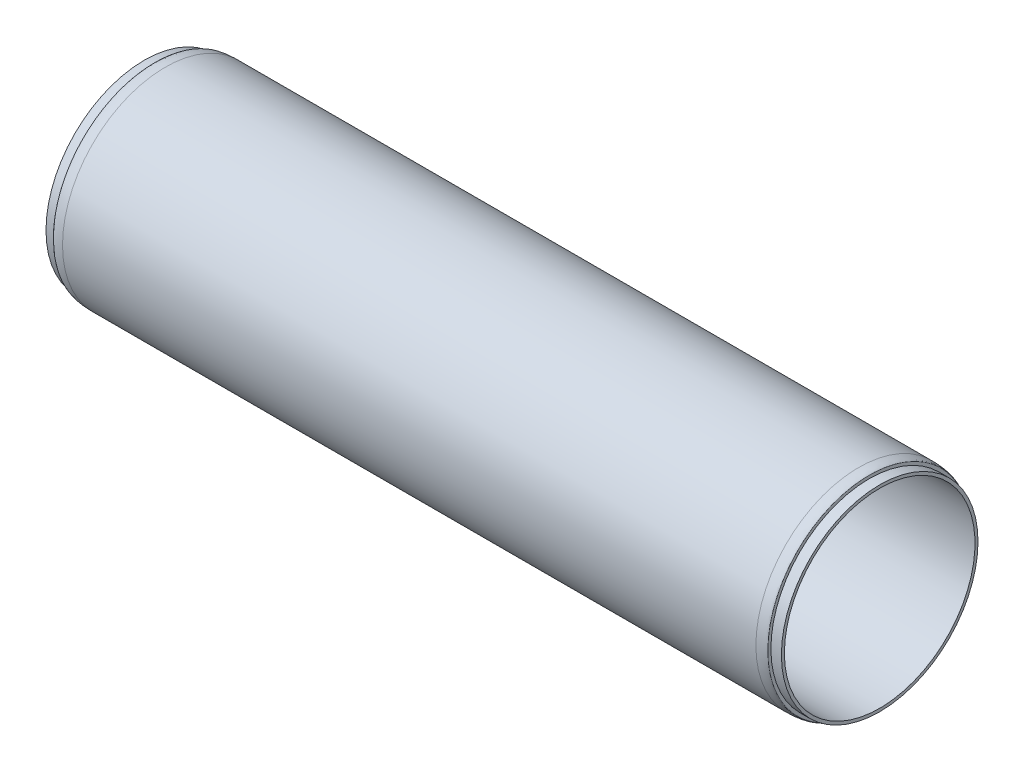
ISO-10303-21;
HEADER;
FILE_DESCRIPTION(('STEP AP214'),'2;1');
FILE_NAME('part.step','',(''),(''),'','','');
FILE_SCHEMA(('AUTOMOTIVE_DESIGN { 1 0 10303 214 1 1 1 1 }'));
ENDSEC;
DATA;
#1=APPLICATION_CONTEXT('core data for automotive mechanical design processes');
#2=APPLICATION_PROTOCOL_DEFINITION('international standard','automotive_design',2000,#1);
#3=PRODUCT_CONTEXT('',#1,'mechanical');
#4=PRODUCT('Part','Part','',(#3));
#5=PRODUCT_RELATED_PRODUCT_CATEGORY('part','',(#4));
#6=PRODUCT_DEFINITION_FORMATION('','',#4);
#7=PRODUCT_DEFINITION_CONTEXT('part definition',#1,'design');
#8=PRODUCT_DEFINITION('design','',#6,#7);
#9=PRODUCT_DEFINITION_SHAPE('','',#8);
#10=(LENGTH_UNIT() NAMED_UNIT(*) SI_UNIT(.MILLI.,.METRE.));
#11=(NAMED_UNIT(*) PLANE_ANGLE_UNIT() SI_UNIT($,.RADIAN.));
#12=(NAMED_UNIT(*) SI_UNIT($,.STERADIAN.) SOLID_ANGLE_UNIT());
#13=UNCERTAINTY_MEASURE_WITH_UNIT(LENGTH_MEASURE(1.E-05),#10,'distance_accuracy_value','');
#14=(GEOMETRIC_REPRESENTATION_CONTEXT(3) GLOBAL_UNCERTAINTY_ASSIGNED_CONTEXT((#13)) GLOBAL_UNIT_ASSIGNED_CONTEXT((#10,
#11,#12)) REPRESENTATION_CONTEXT('',''));
#15=CARTESIAN_POINT('',(0.,0.,0.));
#16=DIRECTION('',(0.,0.,1.));
#17=DIRECTION('',(1.,0.,0.));
#18=AXIS2_PLACEMENT_3D('',#15,#16,#17);
#19=CARTESIAN_POINT('',(62.23,0.,0.));
#20=DIRECTION('',(1.,0.,0.));
#21=DIRECTION('',(0.,0.,-1.));
#22=AXIS2_PLACEMENT_3D('',#19,#20,#21);
#23=PLANE('',#22);
#24=CARTESIAN_POINT('',(62.23,0.,0.));
#25=DIRECTION('',(1.,0.,0.));
#26=DIRECTION('',(0.,0.,-1.));
#27=AXIS2_PLACEMENT_3D('',#24,#25,#26);
#28=CIRCLE('',#27,8.3185);
#29=CARTESIAN_POINT('',(62.23,0.,-8.3185));
#30=VERTEX_POINT('',#29);
#31=EDGE_CURVE('E68',#30,#30,#28,.T.);
#32=ORIENTED_EDGE('',*,*,#31,.T.);
#33=EDGE_LOOP('',(#32));
#34=FACE_BOUND('',#33,.T.);
#35=CARTESIAN_POINT('',(62.23,0.,0.));
#36=DIRECTION('',(1.,0.,0.));
#37=DIRECTION('',(0.,0.,-1.));
#38=AXIS2_PLACEMENT_3D('',#35,#36,#37);
#39=CIRCLE('',#38,8.0645);
#40=CARTESIAN_POINT('',(62.23,0.,8.0645));
#41=VERTEX_POINT('',#40);
#42=EDGE_CURVE('E11',#41,#41,#39,.T.);
#43=ORIENTED_EDGE('',*,*,#42,.F.);
#44=EDGE_LOOP('',(#43));
#45=FACE_BOUND('',#44,.T.);
#46=ADVANCED_FACE('F42',(#34,#45),#23,.T.);
#47=CARTESIAN_POINT('',(0.,0.,0.));
#48=DIRECTION('',(1.,0.,0.));
#49=DIRECTION('',(0.,0.,-1.));
#50=AXIS2_PLACEMENT_3D('',#47,#48,#49);
#51=PLANE('',#50);
#52=CARTESIAN_POINT('',(0.,0.,0.));
#53=DIRECTION('',(1.,0.,0.));
#54=DIRECTION('',(0.,0.,-1.));
#55=AXIS2_PLACEMENT_3D('',#52,#53,#54);
#56=CIRCLE('',#55,8.3185);
#57=CARTESIAN_POINT('',(0.,0.,-8.3185));
#58=VERTEX_POINT('',#57);
#59=EDGE_CURVE('E53',#58,#58,#56,.T.);
#60=ORIENTED_EDGE('',*,*,#59,.F.);
#61=EDGE_LOOP('',(#60));
#62=FACE_BOUND('',#61,.T.);
#63=CARTESIAN_POINT('',(0.,0.,0.));
#64=DIRECTION('',(1.,0.,0.));
#65=DIRECTION('',(0.,0.,-1.));
#66=AXIS2_PLACEMENT_3D('',#63,#64,#65);
#67=CIRCLE('',#66,8.0645);
#68=CARTESIAN_POINT('',(0.,0.,8.0645));
#69=VERTEX_POINT('',#68);
#70=EDGE_CURVE('E49',#69,#69,#67,.T.);
#71=ORIENTED_EDGE('',*,*,#70,.T.);
#72=EDGE_LOOP('',(#71));
#73=FACE_BOUND('',#72,.T.);
#74=ADVANCED_FACE('F91',(#62,#73),#51,.F.);
#75=CARTESIAN_POINT('',(62.23,0.,0.));
#76=DIRECTION('',(-1.,0.,0.));
#77=DIRECTION('',(0.,0.,1.));
#78=AXIS2_PLACEMENT_3D('',#75,#76,#77);
#79=CYLINDRICAL_SURFACE('',#78,8.6995);
#80=CARTESIAN_POINT('',(60.452,0.,0.));
#81=DIRECTION('',(1.,0.,0.));
#82=DIRECTION('',(0.,0.,-1.));
#83=AXIS2_PLACEMENT_3D('',#80,#81,#82);
#84=CIRCLE('',#83,8.6995);
#85=CARTESIAN_POINT('',(60.452,0.,8.6995));
#86=VERTEX_POINT('',#85);
#87=EDGE_CURVE('E109',#86,#86,#84,.T.);
#88=CARTESIAN_POINT('',(1.778,0.,0.));
#89=DIRECTION('',(1.,0.,0.));
#90=DIRECTION('',(0.,0.,-1.));
#91=AXIS2_PLACEMENT_3D('',#88,#89,#90);
#92=CIRCLE('',#91,8.6995);
#93=CARTESIAN_POINT('',(1.778,0.,8.6995));
#94=VERTEX_POINT('',#93);
#95=EDGE_CURVE('E65',#94,#94,#92,.T.);
#96=CARTESIAN_POINT('',(60.452,0.,8.6995));
#97=CARTESIAN_POINT('',(59.8408125,0.,8.6995));
#98=CARTESIAN_POINT('',(59.229625,0.,8.6995));
#99=CARTESIAN_POINT('',(58.00725,0.,8.6995));
#100=CARTESIAN_POINT('',(57.3960625,0.,8.6995));
#101=CARTESIAN_POINT('',(56.1736875,0.,8.6995));
#102=CARTESIAN_POINT('',(55.5625,0.,8.6995));
#103=CARTESIAN_POINT('',(54.340125,0.,8.6995));
#104=CARTESIAN_POINT('',(53.7289375,0.,8.6995));
#105=CARTESIAN_POINT('',(52.5065625,0.,8.6995));
#106=CARTESIAN_POINT('',(51.895375,0.,8.6995));
#107=CARTESIAN_POINT('',(50.673,0.,8.6995));
#108=CARTESIAN_POINT('',(50.0618125,0.,8.6995));
#109=CARTESIAN_POINT('',(48.8394375,0.,8.6995));
#110=CARTESIAN_POINT('',(48.22825,0.,8.6995));
#111=CARTESIAN_POINT('',(47.005875,0.,8.6995));
#112=CARTESIAN_POINT('',(46.3946875,0.,8.6995));
#113=CARTESIAN_POINT('',(45.1723125,0.,8.6995));
#114=CARTESIAN_POINT('',(44.561125,0.,8.6995));
#115=CARTESIAN_POINT('',(43.33875,0.,8.6995));
#116=CARTESIAN_POINT('',(42.7275625,0.,8.6995));
#117=CARTESIAN_POINT('',(41.5051875,0.,8.6995));
#118=CARTESIAN_POINT('',(40.894,0.,8.6995));
#119=CARTESIAN_POINT('',(39.671625,0.,8.6995));
#120=CARTESIAN_POINT('',(39.0604375,0.,8.6995));
#121=CARTESIAN_POINT('',(37.8380625,0.,8.6995));
#122=CARTESIAN_POINT('',(37.226875,0.,8.6995));
#123=CARTESIAN_POINT('',(36.0045,0.,8.6995));
#124=CARTESIAN_POINT('',(35.3933125,0.,8.6995));
#125=CARTESIAN_POINT('',(34.1709375,0.,8.6995));
#126=CARTESIAN_POINT('',(33.55975,0.,8.6995));
#127=CARTESIAN_POINT('',(32.337375,0.,8.6995));
#128=CARTESIAN_POINT('',(31.7261875,0.,8.6995));
#129=CARTESIAN_POINT('',(30.5038125,0.,8.6995));
#130=CARTESIAN_POINT('',(29.892625,0.,8.6995));
#131=CARTESIAN_POINT('',(28.67025,0.,8.6995));
#132=CARTESIAN_POINT('',(28.0590625,0.,8.6995));
#133=CARTESIAN_POINT('',(26.8366875,0.,8.6995));
#134=CARTESIAN_POINT('',(26.2255,0.,8.6995));
#135=CARTESIAN_POINT('',(25.003125,0.,8.6995));
#136=CARTESIAN_POINT('',(24.3919375,0.,8.6995));
#137=CARTESIAN_POINT('',(23.1695625,0.,8.6995));
#138=CARTESIAN_POINT('',(22.558375,0.,8.6995));
#139=CARTESIAN_POINT('',(21.336,0.,8.6995));
#140=CARTESIAN_POINT('',(20.7248125,0.,8.6995));
#141=CARTESIAN_POINT('',(19.5024375,0.,8.6995));
#142=CARTESIAN_POINT('',(18.89125,0.,8.6995));
#143=CARTESIAN_POINT('',(17.668875,0.,8.6995));
#144=CARTESIAN_POINT('',(17.0576875,0.,8.6995));
#145=CARTESIAN_POINT('',(15.8353125,0.,8.6995));
#146=CARTESIAN_POINT('',(15.224125,0.,8.6995));
#147=CARTESIAN_POINT('',(14.00175,0.,8.6995));
#148=CARTESIAN_POINT('',(13.3905625,0.,8.6995));
#149=CARTESIAN_POINT('',(12.1681875,0.,8.6995));
#150=CARTESIAN_POINT('',(11.557,0.,8.6995));
#151=CARTESIAN_POINT('',(10.334625,0.,8.6995));
#152=CARTESIAN_POINT('',(9.7234375,0.,8.6995));
#153=CARTESIAN_POINT('',(8.5010625,0.,8.6995));
#154=CARTESIAN_POINT('',(7.889875,0.,8.6995));
#155=CARTESIAN_POINT('',(6.6675,0.,8.6995));
#156=CARTESIAN_POINT('',(6.0563125,0.,8.6995));
#157=CARTESIAN_POINT('',(4.8339375,0.,8.6995));
#158=CARTESIAN_POINT('',(4.22275,0.,8.6995));
#159=CARTESIAN_POINT('',(3.000375,0.,8.6995));
#160=CARTESIAN_POINT('',(2.3891875,0.,8.6995));
#161=CARTESIAN_POINT('',(1.778,0.,8.6995));
#162=B_SPLINE_CURVE_WITH_KNOTS('',3,(#96,#97,#98,#99,#100,#101,#102,#103,#104,#105,#106,#107,
#108,#109,#110,#111,#112,#113,#114,#115,#116,#117,#118,#119,#120,#121,#122,#123,#124,#125,#126,
#127,#128,#129,#130,#131,#132,#133,#134,#135,#136,#137,#138,#139,#140,#141,#142,#143,#144,#145,
#146,#147,#148,#149,#150,#151,#152,#153,#154,#155,#156,#157,#158,#159,#160,#161),.UNSPECIFIED.,
.F.,.F.,(4,2,2,2,2,2,2,2,2,2,2,2,2,2,2,2,2,2,2,2,2,2,2,2,2,2,2,2,2,2,2,2,4),(0.,1.8335625,
3.667125,5.5006875,7.33425,9.1678125,11.001375,12.8349375,14.6685,16.5020625,18.335625,
20.1691875,22.00275,23.8363125,25.669875,27.5034375,29.337,31.1705625,33.004125,34.8376875,
36.67125,38.5048125,40.338375,42.1719375,44.0055,45.8390625,47.672625,49.5061875,51.33975,
53.1733125,55.006875,56.8404375,58.674),.UNSPECIFIED.);
#163=EDGE_CURVE('BSEAM44',#86,#94,#162,.T.);
#164=ORIENTED_EDGE('',*,*,#87,.F.);
#165=ORIENTED_EDGE('',*,*,#95,.T.);
#166=ORIENTED_EDGE('',*,*,#163,.T.);
#167=ORIENTED_EDGE('',*,*,#163,.F.);
#168=EDGE_LOOP('',(#164,#166,#165,#167));
#169=FACE_BOUND('',#168,.T.);
#170=ADVANCED_FACE('F44',(#169),#79,.T.);
#171=CARTESIAN_POINT('',(62.23,0.,0.));
#172=DIRECTION('',(-1.,0.,0.));
#173=DIRECTION('',(0.,0.,1.));
#174=AXIS2_PLACEMENT_3D('',#171,#172,#173);
#175=CYLINDRICAL_SURFACE('',#174,8.0645);
#176=CARTESIAN_POINT('',(62.23,0.,8.0645));
#177=CARTESIAN_POINT('',(61.5817708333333,0.,8.0645));
#178=CARTESIAN_POINT('',(60.9335416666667,0.,8.0645));
#179=CARTESIAN_POINT('',(59.6370833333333,0.,8.0645));
#180=CARTESIAN_POINT('',(58.9888541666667,0.,8.0645));
#181=CARTESIAN_POINT('',(57.6923958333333,0.,8.0645));
#182=CARTESIAN_POINT('',(57.0441666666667,0.,8.0645));
#183=CARTESIAN_POINT('',(55.7477083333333,0.,8.0645));
#184=CARTESIAN_POINT('',(55.0994791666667,0.,8.0645));
#185=CARTESIAN_POINT('',(53.8030208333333,0.,8.0645));
#186=CARTESIAN_POINT('',(53.1547916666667,0.,8.0645));
#187=CARTESIAN_POINT('',(51.8583333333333,0.,8.0645));
#188=CARTESIAN_POINT('',(51.2101041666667,0.,8.0645));
#189=CARTESIAN_POINT('',(49.9136458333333,0.,8.0645));
#190=CARTESIAN_POINT('',(49.2654166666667,0.,8.0645));
#191=CARTESIAN_POINT('',(47.9689583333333,0.,8.0645));
#192=CARTESIAN_POINT('',(47.3207291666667,0.,8.0645));
#193=CARTESIAN_POINT('',(46.0242708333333,0.,8.0645));
#194=CARTESIAN_POINT('',(45.3760416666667,0.,8.0645));
#195=CARTESIAN_POINT('',(44.0795833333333,0.,8.0645));
#196=CARTESIAN_POINT('',(43.4313541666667,0.,8.0645));
#197=CARTESIAN_POINT('',(42.1348958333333,0.,8.0645));
#198=CARTESIAN_POINT('',(41.4866666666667,0.,8.0645));
#199=CARTESIAN_POINT('',(40.1902083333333,0.,8.0645));
#200=CARTESIAN_POINT('',(39.5419791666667,0.,8.0645));
#201=CARTESIAN_POINT('',(38.2455208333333,0.,8.0645));
#202=CARTESIAN_POINT('',(37.5972916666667,0.,8.0645));
#203=CARTESIAN_POINT('',(36.3008333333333,0.,8.0645));
#204=CARTESIAN_POINT('',(35.6526041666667,0.,8.0645));
#205=CARTESIAN_POINT('',(34.3561458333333,0.,8.0645));
#206=CARTESIAN_POINT('',(33.7079166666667,0.,8.0645));
#207=CARTESIAN_POINT('',(32.4114583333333,0.,8.0645));
#208=CARTESIAN_POINT('',(31.7632291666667,0.,8.0645));
#209=CARTESIAN_POINT('',(30.4667708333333,0.,8.0645));
#210=CARTESIAN_POINT('',(29.8185416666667,0.,8.0645));
#211=CARTESIAN_POINT('',(28.5220833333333,0.,8.0645));
#212=CARTESIAN_POINT('',(27.8738541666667,0.,8.0645));
#213=CARTESIAN_POINT('',(26.5773958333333,0.,8.0645));
#214=CARTESIAN_POINT('',(25.9291666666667,0.,8.0645));
#215=CARTESIAN_POINT('',(24.6327083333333,0.,8.0645));
#216=CARTESIAN_POINT('',(23.9844791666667,0.,8.0645));
#217=CARTESIAN_POINT('',(22.6880208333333,0.,8.0645));
#218=CARTESIAN_POINT('',(22.0397916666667,0.,8.0645));
#219=CARTESIAN_POINT('',(20.7433333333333,0.,8.0645));
#220=CARTESIAN_POINT('',(20.0951041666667,0.,8.0645));
#221=CARTESIAN_POINT('',(18.7986458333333,0.,8.0645));
#222=CARTESIAN_POINT('',(18.1504166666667,0.,8.0645));
#223=CARTESIAN_POINT('',(16.8539583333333,0.,8.0645));
#224=CARTESIAN_POINT('',(16.2057291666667,0.,8.0645));
#225=CARTESIAN_POINT('',(14.9092708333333,0.,8.0645));
#226=CARTESIAN_POINT('',(14.2610416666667,0.,8.0645));
#227=CARTESIAN_POINT('',(12.9645833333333,0.,8.0645));
#228=CARTESIAN_POINT('',(12.3163541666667,0.,8.0645));
#229=CARTESIAN_POINT('',(11.0198958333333,0.,8.0645));
#230=CARTESIAN_POINT('',(10.3716666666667,0.,8.0645));
#231=CARTESIAN_POINT('',(9.07520833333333,0.,8.0645));
#232=CARTESIAN_POINT('',(8.42697916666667,0.,8.0645));
#233=CARTESIAN_POINT('',(7.13052083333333,0.,8.0645));
#234=CARTESIAN_POINT('',(6.48229166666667,0.,8.0645));
#235=CARTESIAN_POINT('',(5.18583333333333,0.,8.0645));
#236=CARTESIAN_POINT('',(4.53760416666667,0.,8.0645));
#237=CARTESIAN_POINT('',(3.24114583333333,0.,8.0645));
#238=CARTESIAN_POINT('',(2.59291666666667,0.,8.0645));
#239=CARTESIAN_POINT('',(1.29645833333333,0.,8.0645));
#240=CARTESIAN_POINT('',(0.648229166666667,0.,8.0645));
#241=CARTESIAN_POINT('',(0.,0.,8.0645));
#242=B_SPLINE_CURVE_WITH_KNOTS('',3,(#176,#177,#178,#179,#180,#181,#182,#183,#184,#185,#186,
#187,#188,#189,#190,#191,#192,#193,#194,#195,#196,#197,#198,#199,#200,#201,#202,#203,#204,#205,
#206,#207,#208,#209,#210,#211,#212,#213,#214,#215,#216,#217,#218,#219,#220,#221,#222,#223,#224,
#225,#226,#227,#228,#229,#230,#231,#232,#233,#234,#235,#236,#237,#238,#239,#240,#241),
.UNSPECIFIED.,.F.,.F.,(4,2,2,2,2,2,2,2,2,2,2,2,2,2,2,2,2,2,2,2,2,2,2,2,2,2,2,2,2,2,2,2,4),(0.,
1.9446875,3.889375,5.8340625,7.77875,9.7234375,11.668125,13.6128125,15.5575,17.5021875,
19.446875,21.3915625,23.33625,25.2809375,27.225625,29.1703125,31.115,33.0596875,35.004375,
36.9490625,38.89375,40.8384375,42.783125,44.7278125,46.6725,48.6171875,50.561875,52.5065625,
54.45125,56.3959375,58.340625,60.2853125,62.23),.UNSPECIFIED.);
#243=EDGE_CURVE('BSEAM87',#41,#69,#242,.T.);
#244=ORIENTED_EDGE('',*,*,#42,.T.);
#245=ORIENTED_EDGE('',*,*,#70,.F.);
#246=ORIENTED_EDGE('',*,*,#243,.T.);
#247=ORIENTED_EDGE('',*,*,#243,.F.);
#248=EDGE_LOOP('',(#244,#246,#245,#247));
#249=FACE_BOUND('',#248,.T.);
#250=ADVANCED_FACE('F87',(#249),#175,.F.);
#251=CARTESIAN_POINT('',(62.23,0.,0.));
#252=DIRECTION('',(1.,0.,0.));
#253=DIRECTION('',(0.,0.,-1.));
#254=AXIS2_PLACEMENT_3D('',#251,#252,#253);
#255=CYLINDRICAL_SURFACE('',#254,8.3185);
#256=CARTESIAN_POINT('',(0.889000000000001,0.,0.));
#257=DIRECTION('',(1.,0.,0.));
#258=DIRECTION('',(0.,0.,-1.));
#259=AXIS2_PLACEMENT_3D('',#256,#257,#258);
#260=CIRCLE('',#259,8.3185);
#261=CARTESIAN_POINT('',(0.889000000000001,0.,-8.3185));
#262=VERTEX_POINT('',#261);
#263=EDGE_CURVE('E57',#262,#262,#260,.T.);
#264=ORIENTED_EDGE('',*,*,#263,.F.);
#265=EDGE_LOOP('',(#264));
#266=FACE_BOUND('',#265,.T.);
#267=ORIENTED_EDGE('',*,*,#59,.T.);
#268=EDGE_LOOP('',(#267));
#269=FACE_BOUND('',#268,.T.);
#270=ADVANCED_FACE('F83',(#266,#269),#255,.T.);
#271=CARTESIAN_POINT('',(0.889,8.5725,0.));
#272=DIRECTION('',(1.,0.,0.));
#273=DIRECTION('',(0.,0.,-1.));
#274=AXIS2_PLACEMENT_3D('',#271,#272,#273);
#275=PLANE('',#274);
#276=CARTESIAN_POINT('',(0.889000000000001,0.,0.));
#277=DIRECTION('',(1.,0.,0.));
#278=DIRECTION('',(0.,0.,-1.));
#279=AXIS2_PLACEMENT_3D('',#276,#277,#278);
#280=CIRCLE('',#279,8.5725);
#281=CARTESIAN_POINT('',(0.889000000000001,0.,-8.5725));
#282=VERTEX_POINT('',#281);
#283=EDGE_CURVE('E62',#282,#282,#280,.T.);
#284=ORIENTED_EDGE('',*,*,#283,.F.);
#285=EDGE_LOOP('',(#284));
#286=FACE_BOUND('',#285,.T.);
#287=ORIENTED_EDGE('',*,*,#263,.T.);
#288=EDGE_LOOP('',(#287));
#289=FACE_BOUND('',#288,.T.);
#290=ADVANCED_FACE('F78',(#286,#289),#275,.F.);
#291=CARTESIAN_POINT('',(1.778,8.5725,0.));
#292=DIRECTION('',(0.,0.,-1.));
#293=DIRECTION('',(-1.,0.,0.));
#294=AXIS2_PLACEMENT_3D('',#291,#292,#293);
#295=ELLIPSE('',#294,0.888999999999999,0.127);
#296=CARTESIAN_POINT('',(62.23,0.,0.));
#297=DIRECTION('',(1.,0.,0.));
#298=AXIS1_PLACEMENT('',#296,#297);
#299=SURFACE_OF_REVOLUTION('',#295,#298);
#300=ORIENTED_EDGE('',*,*,#95,.F.);
#301=EDGE_LOOP('',(#300));
#302=FACE_BOUND('',#301,.T.);
#303=ORIENTED_EDGE('',*,*,#283,.T.);
#304=EDGE_LOOP('',(#303));
#305=FACE_BOUND('',#304,.T.);
#306=ADVANCED_FACE('F73',(#302,#305),#299,.T.);
#307=CARTESIAN_POINT('',(0.,0.,0.));
#308=DIRECTION('',(-1.,0.,0.));
#309=DIRECTION('',(0.,0.,-1.));
#310=AXIS2_PLACEMENT_3D('',#307,#308,#309);
#311=CYLINDRICAL_SURFACE('',#310,8.3185);
#312=CARTESIAN_POINT('',(61.341,0.,0.));
#313=DIRECTION('',(1.,0.,0.));
#314=DIRECTION('',(0.,0.,-1.));
#315=AXIS2_PLACEMENT_3D('',#312,#313,#314);
#316=CIRCLE('',#315,8.3185);
#317=CARTESIAN_POINT('',(61.341,0.,-8.3185));
#318=VERTEX_POINT('',#317);
#319=EDGE_CURVE('E103',#318,#318,#316,.T.);
#320=ORIENTED_EDGE('',*,*,#319,.T.);
#321=EDGE_LOOP('',(#320));
#322=FACE_BOUND('',#321,.T.);
#323=ORIENTED_EDGE('',*,*,#31,.F.);
#324=EDGE_LOOP('',(#323));
#325=FACE_BOUND('',#324,.T.);
#326=ADVANCED_FACE('F77',(#322,#325),#311,.T.);
#327=CARTESIAN_POINT('',(61.341,8.5725,0.));
#328=DIRECTION('',(-1.,0.,0.));
#329=DIRECTION('',(0.,0.,-1.));
#330=AXIS2_PLACEMENT_3D('',#327,#328,#329);
#331=PLANE('',#330);
#332=CARTESIAN_POINT('',(61.341,0.,0.));
#333=DIRECTION('',(1.,0.,0.));
#334=DIRECTION('',(0.,0.,-1.));
#335=AXIS2_PLACEMENT_3D('',#332,#333,#334);
#336=CIRCLE('',#335,8.5725);
#337=CARTESIAN_POINT('',(61.341,0.,-8.5725));
#338=VERTEX_POINT('',#337);
#339=EDGE_CURVE('E105',#338,#338,#336,.T.);
#340=ORIENTED_EDGE('',*,*,#339,.T.);
#341=EDGE_LOOP('',(#340));
#342=FACE_BOUND('',#341,.T.);
#343=ORIENTED_EDGE('',*,*,#319,.F.);
#344=EDGE_LOOP('',(#343));
#345=FACE_BOUND('',#344,.T.);
#346=ADVANCED_FACE('F118',(#342,#345),#331,.F.);
#347=CARTESIAN_POINT('',(60.452,8.5725,0.));
#348=DIRECTION('',(0.,0.,1.));
#349=DIRECTION('',(1.,0.,0.));
#350=AXIS2_PLACEMENT_3D('',#347,#348,#349);
#351=ELLIPSE('',#350,0.888999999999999,0.127);
#352=CARTESIAN_POINT('',(0.,0.,0.));
#353=DIRECTION('',(-1.,0.,0.));
#354=AXIS1_PLACEMENT('',#352,#353);
#355=SURFACE_OF_REVOLUTION('',#351,#354);
#356=ORIENTED_EDGE('',*,*,#87,.T.);
#357=EDGE_LOOP('',(#356));
#358=FACE_BOUND('',#357,.T.);
#359=ORIENTED_EDGE('',*,*,#339,.F.);
#360=EDGE_LOOP('',(#359));
#361=FACE_BOUND('',#360,.T.);
#362=ADVANCED_FACE('F116',(#358,#361),#355,.T.);
#363=CLOSED_SHELL('',(#46,#74,#170,#250,#270,#290,#306,#326,#346,#362));
#364=MANIFOLD_SOLID_BREP('B2',#363);
#365=ADVANCED_BREP_SHAPE_REPRESENTATION('',(#18,#364),#14);
#366=SHAPE_DEFINITION_REPRESENTATION(#9,#365);
ENDSEC;
END-ISO-10303-21;
